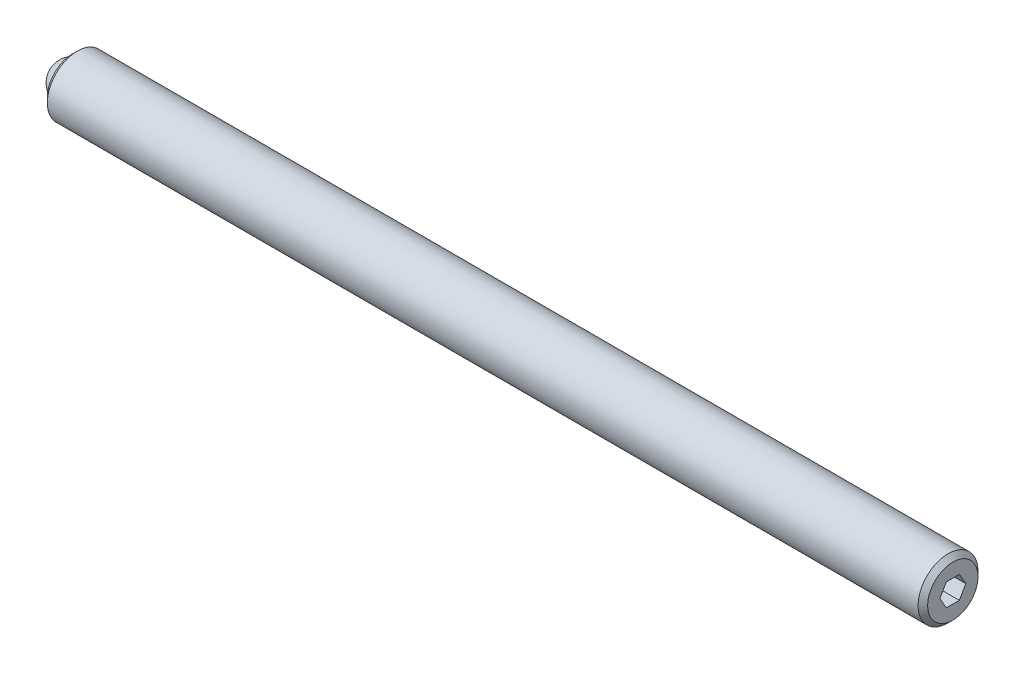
ISO-10303-21;
HEADER;
FILE_DESCRIPTION(('STEP AP214'),'2;1');
FILE_NAME('part.step','',(''),(''),'','','');
FILE_SCHEMA(('AUTOMOTIVE_DESIGN { 1 0 10303 214 1 1 1 1 }'));
ENDSEC;
DATA;
#1=APPLICATION_CONTEXT('core data for automotive mechanical design processes');
#2=APPLICATION_PROTOCOL_DEFINITION('international standard','automotive_design',2000,#1);
#3=PRODUCT_CONTEXT('',#1,'mechanical');
#4=PRODUCT('Part','Part','',(#3));
#5=PRODUCT_RELATED_PRODUCT_CATEGORY('part','',(#4));
#6=PRODUCT_DEFINITION_FORMATION('','',#4);
#7=PRODUCT_DEFINITION_CONTEXT('part definition',#1,'design');
#8=PRODUCT_DEFINITION('design','',#6,#7);
#9=PRODUCT_DEFINITION_SHAPE('','',#8);
#10=(LENGTH_UNIT() NAMED_UNIT(*) SI_UNIT(.MILLI.,.METRE.));
#11=(NAMED_UNIT(*) PLANE_ANGLE_UNIT() SI_UNIT($,.RADIAN.));
#12=(NAMED_UNIT(*) SI_UNIT($,.STERADIAN.) SOLID_ANGLE_UNIT());
#13=UNCERTAINTY_MEASURE_WITH_UNIT(LENGTH_MEASURE(1.E-05),#10,'distance_accuracy_value','');
#14=(GEOMETRIC_REPRESENTATION_CONTEXT(3) GLOBAL_UNCERTAINTY_ASSIGNED_CONTEXT((#13)) GLOBAL_UNIT_ASSIGNED_CONTEXT((#10,
#11,#12)) REPRESENTATION_CONTEXT('',''));
#15=CARTESIAN_POINT('',(0.,0.,0.));
#16=DIRECTION('',(0.,0.,1.));
#17=DIRECTION('',(1.,0.,0.));
#18=AXIS2_PLACEMENT_3D('',#15,#16,#17);
#19=CARTESIAN_POINT('',(0.,0.,0.));
#20=DIRECTION('',(0.,-1.,0.));
#21=DIRECTION('',(0.,0.,1.));
#22=AXIS2_PLACEMENT_3D('',#19,#20,#21);
#23=SPHERICAL_SURFACE('',#22,1.984375);
#24=CARTESIAN_POINT('',(0.,-1.984375,0.));
#25=VERTEX_POINT('',#24);
#26=VERTEX_LOOP('',#25);
#27=FACE_BOUND('',#26,.T.);
#28=ADVANCED_FACE('F41',(#27),#23,.T.);
#29=CLOSED_SHELL('',(#28));
#30=MANIFOLD_SOLID_BREP('B2',#29);
#31=CARTESIAN_POINT('',(93.265625,0.,0.));
#32=DIRECTION('',(-1.,0.,0.));
#33=DIRECTION('',(0.,0.,1.));
#34=AXIS2_PLACEMENT_3D('',#31,#32,#33);
#35=CYLINDRICAL_SURFACE('',#34,3.175);
#36=CARTESIAN_POINT('',(92.757625,0.,0.));
#37=DIRECTION('',(1.,0.,0.));
#38=DIRECTION('',(0.,0.,-1.));
#39=AXIS2_PLACEMENT_3D('',#36,#37,#38);
#40=CIRCLE('',#39,3.175);
#41=CARTESIAN_POINT('',(92.757625,0.,3.175));
#42=VERTEX_POINT('',#41);
#43=EDGE_CURVE('E39',#42,#42,#40,.F.);
#44=CARTESIAN_POINT('',(0.50800000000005,0.,0.));
#45=DIRECTION('',(1.,0.,0.));
#46=DIRECTION('',(0.,0.,-1.));
#47=AXIS2_PLACEMENT_3D('',#44,#45,#46);
#48=CIRCLE('',#47,3.175);
#49=CARTESIAN_POINT('',(0.50800000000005,0.,3.175));
#50=VERTEX_POINT('',#49);
#51=EDGE_CURVE('E157',#50,#50,#48,.T.);
#52=CARTESIAN_POINT('',(92.757625,0.,3.175));
#53=CARTESIAN_POINT('',(91.79669140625,0.,3.175));
#54=CARTESIAN_POINT('',(90.8357578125,0.,3.175));
#55=CARTESIAN_POINT('',(88.913890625,0.,3.175));
#56=CARTESIAN_POINT('',(87.95295703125,0.,3.175));
#57=CARTESIAN_POINT('',(86.03108984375,0.,3.175));
#58=CARTESIAN_POINT('',(85.07015625,0.,3.175));
#59=CARTESIAN_POINT('',(83.1482890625,0.,3.175));
#60=CARTESIAN_POINT('',(82.18735546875,0.,3.175));
#61=CARTESIAN_POINT('',(80.26548828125,0.,3.175));
#62=CARTESIAN_POINT('',(79.3045546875,0.,3.175));
#63=CARTESIAN_POINT('',(77.3826875,0.,3.175));
#64=CARTESIAN_POINT('',(76.42175390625,0.,3.175));
#65=CARTESIAN_POINT('',(74.49988671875,0.,3.175));
#66=CARTESIAN_POINT('',(73.538953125,0.,3.175));
#67=CARTESIAN_POINT('',(71.6170859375,0.,3.175));
#68=CARTESIAN_POINT('',(70.65615234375,0.,3.175));
#69=CARTESIAN_POINT('',(68.73428515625,0.,3.175));
#70=CARTESIAN_POINT('',(67.7733515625,0.,3.175));
#71=CARTESIAN_POINT('',(65.851484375,0.,3.175));
#72=CARTESIAN_POINT('',(64.89055078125,0.,3.175));
#73=CARTESIAN_POINT('',(62.96868359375,0.,3.175));
#74=CARTESIAN_POINT('',(62.00775,0.,3.175));
#75=CARTESIAN_POINT('',(60.0858828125,0.,3.175));
#76=CARTESIAN_POINT('',(59.12494921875,0.,3.175));
#77=CARTESIAN_POINT('',(57.20308203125,0.,3.175));
#78=CARTESIAN_POINT('',(56.2421484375,0.,3.175));
#79=CARTESIAN_POINT('',(54.32028125,0.,3.175));
#80=CARTESIAN_POINT('',(53.35934765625,0.,3.175));
#81=CARTESIAN_POINT('',(51.43748046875,0.,3.175));
#82=CARTESIAN_POINT('',(50.476546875,0.,3.175));
#83=CARTESIAN_POINT('',(48.5546796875,0.,3.175));
#84=CARTESIAN_POINT('',(47.59374609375,0.,3.175));
#85=CARTESIAN_POINT('',(45.67187890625,0.,3.175));
#86=CARTESIAN_POINT('',(44.7109453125,0.,3.175));
#87=CARTESIAN_POINT('',(42.789078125,0.,3.175));
#88=CARTESIAN_POINT('',(41.82814453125,0.,3.175));
#89=CARTESIAN_POINT('',(39.90627734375,0.,3.175));
#90=CARTESIAN_POINT('',(38.94534375,0.,3.175));
#91=CARTESIAN_POINT('',(37.0234765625,0.,3.175));
#92=CARTESIAN_POINT('',(36.06254296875,0.,3.175));
#93=CARTESIAN_POINT('',(34.14067578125,0.,3.175));
#94=CARTESIAN_POINT('',(33.1797421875,0.,3.175));
#95=CARTESIAN_POINT('',(31.257875,0.,3.175));
#96=CARTESIAN_POINT('',(30.29694140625,0.,3.175));
#97=CARTESIAN_POINT('',(28.3750742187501,0.,3.175));
#98=CARTESIAN_POINT('',(27.4141406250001,0.,3.175));
#99=CARTESIAN_POINT('',(25.4922734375,0.,3.175));
#100=CARTESIAN_POINT('',(24.5313398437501,0.,3.175));
#101=CARTESIAN_POINT('',(22.60947265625,0.,3.175));
#102=CARTESIAN_POINT('',(21.6485390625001,0.,3.175));
#103=CARTESIAN_POINT('',(19.7266718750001,0.,3.175));
#104=CARTESIAN_POINT('',(18.7657382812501,0.,3.175));
#105=CARTESIAN_POINT('',(16.84387109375,0.,3.175));
#106=CARTESIAN_POINT('',(15.8829375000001,0.,3.175));
#107=CARTESIAN_POINT('',(13.9610703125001,0.,3.175));
#108=CARTESIAN_POINT('',(13.00013671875,0.,3.175));
#109=CARTESIAN_POINT('',(11.0782695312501,0.,3.175));
#110=CARTESIAN_POINT('',(10.1173359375,0.,3.175));
#111=CARTESIAN_POINT('',(8.19546875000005,0.,3.175));
#112=CARTESIAN_POINT('',(7.23453515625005,0.,3.175));
#113=CARTESIAN_POINT('',(5.31266796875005,0.,3.175));
#114=CARTESIAN_POINT('',(4.35173437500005,0.,3.175));
#115=CARTESIAN_POINT('',(2.42986718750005,0.,3.175));
#116=CARTESIAN_POINT('',(1.46893359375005,0.,3.175));
#117=CARTESIAN_POINT('',(0.50800000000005,0.,3.175));
#118=B_SPLINE_CURVE_WITH_KNOTS('',3,(#52,#53,#54,#55,#56,#57,#58,#59,#60,#61,#62,#63,#64,#65,
#66,#67,#68,#69,#70,#71,#72,#73,#74,#75,#76,#77,#78,#79,#80,#81,#82,#83,#84,#85,#86,#87,#88,#89,
#90,#91,#92,#93,#94,#95,#96,#97,#98,#99,#100,#101,#102,#103,#104,#105,#106,#107,#108,#109,#110,
#111,#112,#113,#114,#115,#116,#117),.UNSPECIFIED.,.F.,.F.,(4,2,2,2,2,2,2,2,2,2,2,2,2,2,2,2,2,2,
2,2,2,2,2,2,2,2,2,2,2,2,2,2,4),(0.,2.88280078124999,5.76560156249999,8.64840234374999,
11.531203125,14.41400390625,17.2968046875,20.17960546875,23.06240625,25.94520703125,
28.8280078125,31.71080859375,34.593609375,37.47641015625,40.3592109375,43.24201171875,
46.1248125,49.00761328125,51.8904140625,54.77321484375,57.656015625,60.53881640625,
63.4216171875,66.30441796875,69.18721875,72.07001953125,74.9528203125,77.83562109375,
80.718421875,83.60122265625,86.4840234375,89.36682421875,92.249625),.UNSPECIFIED.);
#119=EDGE_CURVE('BSEAM54',#42,#50,#118,.T.);
#120=ORIENTED_EDGE('',*,*,#43,.T.);
#121=ORIENTED_EDGE('',*,*,#51,.T.);
#122=ORIENTED_EDGE('',*,*,#119,.T.);
#123=ORIENTED_EDGE('',*,*,#119,.F.);
#124=EDGE_LOOP('',(#120,#122,#121,#123));
#125=FACE_BOUND('',#124,.T.);
#126=ADVANCED_FACE('F54',(#125),#35,.T.);
#127=CARTESIAN_POINT('',(93.265625,0.,0.));
#128=DIRECTION('',(1.,0.,0.));
#129=DIRECTION('',(0.,0.,-1.));
#130=AXIS2_PLACEMENT_3D('',#127,#128,#129);
#131=PLANE('',#130);
#132=DIRECTION('',(0.,0.866025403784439,-0.5));
#133=VECTOR('',#132,1.);
#134=CARTESIAN_POINT('',(93.265625,-1.190625,-0.687407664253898));
#135=LINE('',#134,#133);
#136=CARTESIAN_POINT('',(93.265625,-1.190625,-0.687407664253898));
#137=VERTEX_POINT('',#136);
#138=CARTESIAN_POINT('',(93.265625,0.,-1.3748153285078));
#139=VERTEX_POINT('',#138);
#140=EDGE_CURVE('E69',#137,#139,#135,.T.);
#141=ORIENTED_EDGE('',*,*,#140,.F.);
#142=DIRECTION('',(0.,0.,-1.));
#143=VECTOR('',#142,1.);
#144=CARTESIAN_POINT('',(93.265625,-1.190625,0.687407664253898));
#145=LINE('',#144,#143);
#146=CARTESIAN_POINT('',(93.265625,-1.190625,0.687407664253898));
#147=VERTEX_POINT('',#146);
#148=EDGE_CURVE('E153',#147,#137,#145,.T.);
#149=ORIENTED_EDGE('',*,*,#148,.F.);
#150=DIRECTION('',(0.,-0.866025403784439,-0.5));
#151=VECTOR('',#150,1.);
#152=CARTESIAN_POINT('',(93.265625,0.,1.3748153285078));
#153=LINE('',#152,#151);
#154=CARTESIAN_POINT('',(93.265625,0.,1.3748153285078));
#155=VERTEX_POINT('',#154);
#156=EDGE_CURVE('E151',#155,#147,#153,.T.);
#157=ORIENTED_EDGE('',*,*,#156,.F.);
#158=DIRECTION('',(0.,-0.866025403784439,0.5));
#159=VECTOR('',#158,1.);
#160=CARTESIAN_POINT('',(93.265625,1.190625,0.687407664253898));
#161=LINE('',#160,#159);
#162=CARTESIAN_POINT('',(93.265625,1.190625,0.687407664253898));
#163=VERTEX_POINT('',#162);
#164=EDGE_CURVE('E117',#163,#155,#161,.T.);
#165=ORIENTED_EDGE('',*,*,#164,.F.);
#166=DIRECTION('',(0.,0.,1.));
#167=VECTOR('',#166,1.);
#168=CARTESIAN_POINT('',(93.265625,1.190625,-0.687407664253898));
#169=LINE('',#168,#167);
#170=CARTESIAN_POINT('',(93.265625,1.190625,-0.687407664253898));
#171=VERTEX_POINT('',#170);
#172=EDGE_CURVE('E147',#171,#163,#169,.T.);
#173=ORIENTED_EDGE('',*,*,#172,.F.);
#174=DIRECTION('',(0.,0.866025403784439,0.5));
#175=VECTOR('',#174,1.);
#176=CARTESIAN_POINT('',(93.265625,0.,-1.3748153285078));
#177=LINE('',#176,#175);
#178=EDGE_CURVE('E143',#139,#171,#177,.T.);
#179=ORIENTED_EDGE('',*,*,#178,.F.);
#180=EDGE_LOOP('',(#141,#149,#157,#165,#173,#179));
#181=FACE_BOUND('',#180,.T.);
#182=CARTESIAN_POINT('',(93.265625,0.,0.));
#183=DIRECTION('',(1.,0.,0.));
#184=DIRECTION('',(0.,0.,-1.));
#185=AXIS2_PLACEMENT_3D('',#182,#183,#184);
#186=CIRCLE('',#185,2.66700000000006);
#187=CARTESIAN_POINT('',(93.265625,0.,-2.66700000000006));
#188=VERTEX_POINT('',#187);
#189=EDGE_CURVE('E62',#188,#188,#186,.T.);
#190=ORIENTED_EDGE('',*,*,#189,.T.);
#191=EDGE_LOOP('',(#190));
#192=FACE_BOUND('',#191,.T.);
#193=ADVANCED_FACE('F170',(#181,#192),#131,.T.);
#194=CARTESIAN_POINT('',(0.,0.,0.));
#195=DIRECTION('',(1.,0.,0.));
#196=DIRECTION('',(0.,0.,-1.));
#197=AXIS2_PLACEMENT_3D('',#194,#195,#196);
#198=PLANE('',#197);
#199=CARTESIAN_POINT('',(0.,0.,0.));
#200=DIRECTION('',(-1.,0.,0.));
#201=DIRECTION('',(0.,0.,1.));
#202=AXIS2_PLACEMENT_3D('',#199,#200,#201);
#203=CIRCLE('',#202,1.9812);
#204=CARTESIAN_POINT('',(0.,0.,1.9812));
#205=VERTEX_POINT('',#204);
#206=EDGE_CURVE('E225',#205,#205,#203,.T.);
#207=ORIENTED_EDGE('',*,*,#206,.F.);
#208=EDGE_LOOP('',(#207));
#209=FACE_BOUND('',#208,.T.);
#210=CARTESIAN_POINT('',(0.,0.,0.));
#211=DIRECTION('',(1.,0.,0.));
#212=DIRECTION('',(0.,0.,-1.));
#213=AXIS2_PLACEMENT_3D('',#210,#211,#212);
#214=CIRCLE('',#213,2.66699999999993);
#215=CARTESIAN_POINT('',(0.,0.,-2.66699999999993));
#216=VERTEX_POINT('',#215);
#217=EDGE_CURVE('E165',#216,#216,#214,.F.);
#218=ORIENTED_EDGE('',*,*,#217,.T.);
#219=EDGE_LOOP('',(#218));
#220=FACE_BOUND('',#219,.T.);
#221=ADVANCED_FACE('F182',(#209,#220),#198,.F.);
#222=CARTESIAN_POINT('',(0.50800000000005,0.,0.));
#223=DIRECTION('',(1.,0.,0.));
#224=DIRECTION('',(0.,0.,-1.));
#225=AXIS2_PLACEMENT_3D('',#222,#223,#224);
#226=CONICAL_SURFACE('',#225,3.175,0.785398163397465);
#227=ORIENTED_EDGE('',*,*,#217,.F.);
#228=EDGE_LOOP('',(#227));
#229=FACE_BOUND('',#228,.T.);
#230=ORIENTED_EDGE('',*,*,#51,.F.);
#231=EDGE_LOOP('',(#230));
#232=FACE_BOUND('',#231,.T.);
#233=ADVANCED_FACE('F174',(#229,#232),#226,.T.);
#234=CARTESIAN_POINT('',(93.265625,0.,0.));
#235=DIRECTION('',(-1.,0.,0.));
#236=DIRECTION('',(0.,0.,1.));
#237=AXIS2_PLACEMENT_3D('',#234,#235,#236);
#238=CONICAL_SURFACE('',#237,2.66700000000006,0.785398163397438);
#239=ORIENTED_EDGE('',*,*,#43,.F.);
#240=EDGE_LOOP('',(#239));
#241=FACE_BOUND('',#240,.T.);
#242=ORIENTED_EDGE('',*,*,#189,.F.);
#243=EDGE_LOOP('',(#242));
#244=FACE_BOUND('',#243,.T.);
#245=ADVANCED_FACE('F56',(#241,#244),#238,.T.);
#246=CARTESIAN_POINT('',(90.979625,-1.190625,-0.687407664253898));
#247=DIRECTION('',(0.,-0.5,-0.866025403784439));
#248=DIRECTION('',(0.,0.866025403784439,-0.5));
#249=AXIS2_PLACEMENT_3D('',#246,#247,#248);
#250=PLANE('',#249);
#251=ORIENTED_EDGE('',*,*,#140,.T.);
#252=DIRECTION('',(1.,0.,0.));
#253=VECTOR('',#252,1.);
#254=CARTESIAN_POINT('',(90.979625,0.,-1.3748153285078));
#255=LINE('',#254,#253);
#256=CARTESIAN_POINT('',(90.979625,0.,-1.3748153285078));
#257=VERTEX_POINT('',#256);
#258=EDGE_CURVE('E99',#257,#139,#255,.T.);
#259=ORIENTED_EDGE('',*,*,#258,.F.);
#260=DIRECTION('',(0.,0.866025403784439,-0.5));
#261=VECTOR('',#260,1.);
#262=CARTESIAN_POINT('',(90.979625,-1.190625,-0.687407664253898));
#263=LINE('',#262,#261);
#264=CARTESIAN_POINT('',(90.979625,-1.190625,-0.687407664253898));
#265=VERTEX_POINT('',#264);
#266=EDGE_CURVE('E155',#265,#257,#263,.T.);
#267=ORIENTED_EDGE('',*,*,#266,.F.);
#268=DIRECTION('',(1.,0.,0.));
#269=VECTOR('',#268,1.);
#270=CARTESIAN_POINT('',(90.979625,-1.190625,-0.687407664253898));
#271=LINE('',#270,#269);
#272=EDGE_CURVE('E77',#265,#137,#271,.T.);
#273=ORIENTED_EDGE('',*,*,#272,.T.);
#274=EDGE_LOOP('',(#251,#259,#267,#273));
#275=FACE_BOUND('',#274,.T.);
#276=ADVANCED_FACE('F173',(#275),#250,.F.);
#277=CARTESIAN_POINT('',(90.979625,-1.190625,0.687407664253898));
#278=DIRECTION('',(0.,-1.,0.));
#279=DIRECTION('',(0.,0.,-1.));
#280=AXIS2_PLACEMENT_3D('',#277,#278,#279);
#281=PLANE('',#280);
#282=ORIENTED_EDGE('',*,*,#148,.T.);
#283=ORIENTED_EDGE('',*,*,#272,.F.);
#284=DIRECTION('',(0.,0.,-1.));
#285=VECTOR('',#284,1.);
#286=CARTESIAN_POINT('',(90.979625,-1.190625,0.687407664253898));
#287=LINE('',#286,#285);
#288=CARTESIAN_POINT('',(90.979625,-1.190625,0.687407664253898));
#289=VERTEX_POINT('',#288);
#290=EDGE_CURVE('E129',#289,#265,#287,.T.);
#291=ORIENTED_EDGE('',*,*,#290,.F.);
#292=DIRECTION('',(1.,0.,0.));
#293=VECTOR('',#292,1.);
#294=CARTESIAN_POINT('',(90.979625,-1.190625,0.687407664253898));
#295=LINE('',#294,#293);
#296=EDGE_CURVE('E121',#289,#147,#295,.T.);
#297=ORIENTED_EDGE('',*,*,#296,.T.);
#298=EDGE_LOOP('',(#282,#283,#291,#297));
#299=FACE_BOUND('',#298,.T.);
#300=ADVANCED_FACE('F180',(#299),#281,.F.);
#301=CARTESIAN_POINT('',(90.979625,0.,1.3748153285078));
#302=DIRECTION('',(0.,-0.5,0.866025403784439));
#303=DIRECTION('',(0.,-0.866025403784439,-0.5));
#304=AXIS2_PLACEMENT_3D('',#301,#302,#303);
#305=PLANE('',#304);
#306=ORIENTED_EDGE('',*,*,#156,.T.);
#307=ORIENTED_EDGE('',*,*,#296,.F.);
#308=DIRECTION('',(0.,-0.866025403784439,-0.5));
#309=VECTOR('',#308,1.);
#310=CARTESIAN_POINT('',(90.979625,0.,1.3748153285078));
#311=LINE('',#310,#309);
#312=CARTESIAN_POINT('',(90.979625,0.,1.3748153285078));
#313=VERTEX_POINT('',#312);
#314=EDGE_CURVE('E125',#313,#289,#311,.T.);
#315=ORIENTED_EDGE('',*,*,#314,.F.);
#316=DIRECTION('',(1.,0.,0.));
#317=VECTOR('',#316,1.);
#318=CARTESIAN_POINT('',(90.979625,0.,1.3748153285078));
#319=LINE('',#318,#317);
#320=EDGE_CURVE('E110',#313,#155,#319,.T.);
#321=ORIENTED_EDGE('',*,*,#320,.T.);
#322=EDGE_LOOP('',(#306,#307,#315,#321));
#323=FACE_BOUND('',#322,.T.);
#324=ADVANCED_FACE('F126',(#323),#305,.F.);
#325=CARTESIAN_POINT('',(90.979625,1.190625,0.687407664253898));
#326=DIRECTION('',(0.,0.5,0.866025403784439));
#327=DIRECTION('',(0.,-0.866025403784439,0.5));
#328=AXIS2_PLACEMENT_3D('',#325,#326,#327);
#329=PLANE('',#328);
#330=ORIENTED_EDGE('',*,*,#164,.T.);
#331=ORIENTED_EDGE('',*,*,#320,.F.);
#332=DIRECTION('',(0.,-0.866025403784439,0.5));
#333=VECTOR('',#332,1.);
#334=CARTESIAN_POINT('',(90.979625,1.190625,0.687407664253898));
#335=LINE('',#334,#333);
#336=CARTESIAN_POINT('',(90.979625,1.190625,0.687407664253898));
#337=VERTEX_POINT('',#336);
#338=EDGE_CURVE('E114',#337,#313,#335,.T.);
#339=ORIENTED_EDGE('',*,*,#338,.F.);
#340=DIRECTION('',(1.,0.,0.));
#341=VECTOR('',#340,1.);
#342=CARTESIAN_POINT('',(90.979625,1.190625,0.687407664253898));
#343=LINE('',#342,#341);
#344=EDGE_CURVE('E122',#337,#163,#343,.T.);
#345=ORIENTED_EDGE('',*,*,#344,.T.);
#346=EDGE_LOOP('',(#330,#331,#339,#345));
#347=FACE_BOUND('',#346,.T.);
#348=ADVANCED_FACE('F112',(#347),#329,.F.);
#349=CARTESIAN_POINT('',(90.979625,1.190625,-0.687407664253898));
#350=DIRECTION('',(0.,1.,0.));
#351=DIRECTION('',(0.,0.,1.));
#352=AXIS2_PLACEMENT_3D('',#349,#350,#351);
#353=PLANE('',#352);
#354=ORIENTED_EDGE('',*,*,#172,.T.);
#355=ORIENTED_EDGE('',*,*,#344,.F.);
#356=DIRECTION('',(0.,0.,1.));
#357=VECTOR('',#356,1.);
#358=CARTESIAN_POINT('',(90.979625,1.190625,-0.687407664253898));
#359=LINE('',#358,#357);
#360=CARTESIAN_POINT('',(90.979625,1.190625,-0.687407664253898));
#361=VERTEX_POINT('',#360);
#362=EDGE_CURVE('E135',#361,#337,#359,.T.);
#363=ORIENTED_EDGE('',*,*,#362,.F.);
#364=DIRECTION('',(1.,0.,0.));
#365=VECTOR('',#364,1.);
#366=CARTESIAN_POINT('',(90.979625,1.190625,-0.687407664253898));
#367=LINE('',#366,#365);
#368=EDGE_CURVE('E160',#361,#171,#367,.T.);
#369=ORIENTED_EDGE('',*,*,#368,.T.);
#370=EDGE_LOOP('',(#354,#355,#363,#369));
#371=FACE_BOUND('',#370,.T.);
#372=ADVANCED_FACE('F201',(#371),#353,.F.);
#373=CARTESIAN_POINT('',(90.979625,0.,-1.3748153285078));
#374=DIRECTION('',(0.,0.5,-0.866025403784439));
#375=DIRECTION('',(0.,0.866025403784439,0.5));
#376=AXIS2_PLACEMENT_3D('',#373,#374,#375);
#377=PLANE('',#376);
#378=ORIENTED_EDGE('',*,*,#178,.T.);
#379=ORIENTED_EDGE('',*,*,#368,.F.);
#380=DIRECTION('',(0.,0.866025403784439,0.5));
#381=VECTOR('',#380,1.);
#382=CARTESIAN_POINT('',(90.979625,0.,-1.3748153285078));
#383=LINE('',#382,#381);
#384=EDGE_CURVE('E137',#257,#361,#383,.T.);
#385=ORIENTED_EDGE('',*,*,#384,.F.);
#386=ORIENTED_EDGE('',*,*,#258,.T.);
#387=EDGE_LOOP('',(#378,#379,#385,#386));
#388=FACE_BOUND('',#387,.T.);
#389=ADVANCED_FACE('F198',(#388),#377,.F.);
#390=CARTESIAN_POINT('',(90.979625,0.,0.));
#391=DIRECTION('',(1.,0.,0.));
#392=DIRECTION('',(0.,0.,-1.));
#393=AXIS2_PLACEMENT_3D('',#390,#391,#392);
#394=PLANE('',#393);
#395=ORIENTED_EDGE('',*,*,#266,.T.);
#396=ORIENTED_EDGE('',*,*,#384,.T.);
#397=ORIENTED_EDGE('',*,*,#362,.T.);
#398=ORIENTED_EDGE('',*,*,#338,.T.);
#399=ORIENTED_EDGE('',*,*,#314,.T.);
#400=ORIENTED_EDGE('',*,*,#290,.T.);
#401=EDGE_LOOP('',(#395,#396,#397,#398,#399,#400));
#402=FACE_BOUND('',#401,.T.);
#403=ADVANCED_FACE('F132',(#402),#394,.T.);
#404=CARTESIAN_POINT('',(1.984375,0.,0.));
#405=DIRECTION('',(-1.,0.,0.));
#406=DIRECTION('',(0.,0.,1.));
#407=AXIS2_PLACEMENT_3D('',#404,#405,#406);
#408=CYLINDRICAL_SURFACE('',#407,1.9812);
#409=CARTESIAN_POINT('',(1.984375,0.,0.));
#410=DIRECTION('',(-1.,0.,0.));
#411=DIRECTION('',(0.,0.,1.));
#412=AXIS2_PLACEMENT_3D('',#409,#410,#411);
#413=CIRCLE('',#412,1.9812);
#414=CARTESIAN_POINT('',(1.984375,0.,1.9812));
#415=VERTEX_POINT('',#414);
#416=EDGE_CURVE('E144',#415,#415,#413,.T.);
#417=ORIENTED_EDGE('',*,*,#416,.F.);
#418=EDGE_LOOP('',(#417));
#419=FACE_BOUND('',#418,.T.);
#420=ORIENTED_EDGE('',*,*,#206,.T.);
#421=EDGE_LOOP('',(#420));
#422=FACE_BOUND('',#421,.T.);
#423=ADVANCED_FACE('F214',(#419,#422),#408,.F.);
#424=CARTESIAN_POINT('',(1.984375,0.,0.));
#425=DIRECTION('',(-1.,0.,0.));
#426=DIRECTION('',(0.,0.,1.));
#427=AXIS2_PLACEMENT_3D('',#424,#425,#426);
#428=PLANE('',#427);
#429=ORIENTED_EDGE('',*,*,#416,.T.);
#430=EDGE_LOOP('',(#429));
#431=FACE_BOUND('',#430,.T.);
#432=ADVANCED_FACE('F217',(#431),#428,.T.);
#433=CLOSED_SHELL('',(#126,#193,#221,#233,#245,#276,#300,#324,#348,#372,#389,#403,#423,#432));
#434=MANIFOLD_SOLID_BREP('B6',#433);
#435=ADVANCED_BREP_SHAPE_REPRESENTATION('',(#18,#30,#434),#14);
#436=SHAPE_DEFINITION_REPRESENTATION(#9,#435);
ENDSEC;
END-ISO-10303-21;
